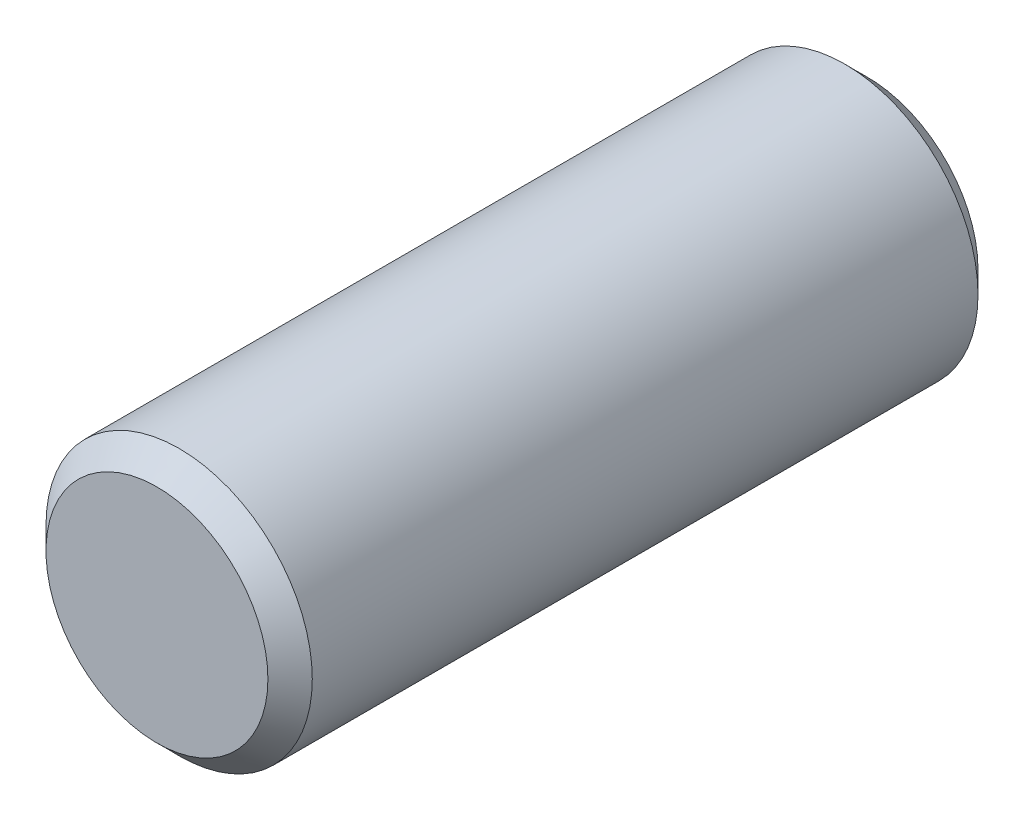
from build123d import *

# Parameters (mm, degrees)
ESQUISSE1_R             = 3
EXTRUSION1_DEPTH        = 16
ENL_V_MAT_EXTRU_1_DEPTH = 4
CHANFREIN1_SIZE         = 0.5


with BuildPart() as part:
    # Esquisse1 → Extrusion1 (new body)
    with BuildSketch(Plane.XY):
        Circle(ESQUISSE1_R)
    extrude(amount=EXTRUSION1_DEPTH)

    # Esquisse2 → Enl_v. mat.-Extru.1 (cut)
    with BuildSketch(Plane(origin=(0, 0, 0), x_dir=(-1, 0, 0), z_dir=(0, 0, -1))):
        Polygon((0.446153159, -1.673603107), (1.672459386, -0.450421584), (1.226306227, 1.223181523), (-0.446153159, 1.673603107), (-1.672459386, 0.450421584), (-1.226306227, -1.223181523), align=None)
    extrude(amount=-ENL_V_MAT_EXTRU_1_DEPTH, mode=Mode.SUBTRACT)

    # Chanfrein1
    chanfrein1_edges = [part.edges().sort_by_distance(p)[0] for p in [
        (-3, 0, 0),
        (-3, 0, 16),
    ]]
    chamfer(chanfrein1_edges, length=CHANFREIN1_SIZE)


solid = part.part
